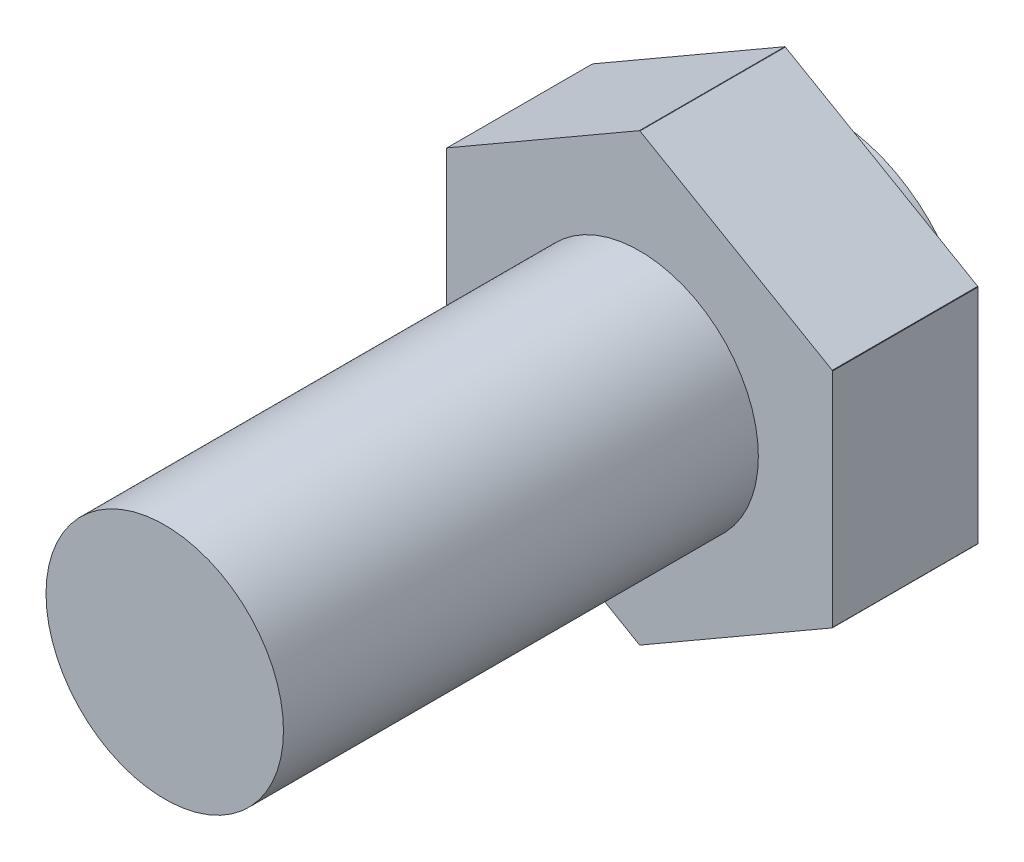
ISO-10303-21;
HEADER;
FILE_DESCRIPTION(('STEP AP214'),'2;1');
FILE_NAME('part.step','',(''),(''),'','','');
FILE_SCHEMA(('AUTOMOTIVE_DESIGN { 1 0 10303 214 1 1 1 1 }'));
ENDSEC;
DATA;
#1=APPLICATION_CONTEXT('core data for automotive mechanical design processes');
#2=APPLICATION_PROTOCOL_DEFINITION('international standard','automotive_design',2000,#1);
#3=PRODUCT_CONTEXT('',#1,'mechanical');
#4=PRODUCT('Part','Part','',(#3));
#5=PRODUCT_RELATED_PRODUCT_CATEGORY('part','',(#4));
#6=PRODUCT_DEFINITION_FORMATION('','',#4);
#7=PRODUCT_DEFINITION_CONTEXT('part definition',#1,'design');
#8=PRODUCT_DEFINITION('design','',#6,#7);
#9=PRODUCT_DEFINITION_SHAPE('','',#8);
#10=(LENGTH_UNIT() NAMED_UNIT(*) SI_UNIT(.MILLI.,.METRE.));
#11=(NAMED_UNIT(*) PLANE_ANGLE_UNIT() SI_UNIT($,.RADIAN.));
#12=(NAMED_UNIT(*) SI_UNIT($,.STERADIAN.) SOLID_ANGLE_UNIT());
#13=UNCERTAINTY_MEASURE_WITH_UNIT(LENGTH_MEASURE(1.E-05),#10,'distance_accuracy_value','');
#14=(GEOMETRIC_REPRESENTATION_CONTEXT(3) GLOBAL_UNCERTAINTY_ASSIGNED_CONTEXT((#13)) GLOBAL_UNIT_ASSIGNED_CONTEXT((#10,
#11,#12)) REPRESENTATION_CONTEXT('',''));
#15=CARTESIAN_POINT('',(0.,0.,0.));
#16=DIRECTION('',(0.,0.,1.));
#17=DIRECTION('',(1.,0.,0.));
#18=AXIS2_PLACEMENT_3D('',#15,#16,#17);
#19=CARTESIAN_POINT('',(0.,0.,-38.6));
#20=DIRECTION('',(0.,0.,-1.));
#21=DIRECTION('',(-1.,0.,0.));
#22=AXIS2_PLACEMENT_3D('',#19,#20,#21);
#23=CYLINDRICAL_SURFACE('',#22,4.);
#24=CARTESIAN_POINT('',(0.,0.,6.4));
#25=DIRECTION('',(0.,0.,-1.));
#26=DIRECTION('',(-1.,0.,0.));
#27=AXIS2_PLACEMENT_3D('',#24,#25,#26);
#28=CIRCLE('',#27,4.);
#29=CARTESIAN_POINT('',(-4.,0.,6.4));
#30=VERTEX_POINT('',#29);
#31=EDGE_CURVE('E23',#30,#30,#28,.T.);
#32=ORIENTED_EDGE('',*,*,#31,.F.);
#33=EDGE_LOOP('',(#32));
#34=FACE_BOUND('',#33,.T.);
#35=CARTESIAN_POINT('',(0.,0.,22.4));
#36=DIRECTION('',(0.,0.,1.));
#37=DIRECTION('',(1.,0.,0.));
#38=AXIS2_PLACEMENT_3D('',#35,#36,#37);
#39=CIRCLE('',#38,4.);
#40=CARTESIAN_POINT('',(4.,0.,22.4));
#41=VERTEX_POINT('',#40);
#42=EDGE_CURVE('E141',#41,#41,#39,.T.);
#43=ORIENTED_EDGE('',*,*,#42,.F.);
#44=EDGE_LOOP('',(#43));
#45=FACE_BOUND('',#44,.T.);
#46=ADVANCED_FACE('F15',(#34,#45),#23,.T.);
#47=CARTESIAN_POINT('',(-4.,0.,6.4));
#48=DIRECTION('',(0.,0.,-1.));
#49=DIRECTION('',(-1.,0.,0.));
#50=AXIS2_PLACEMENT_3D('',#47,#48,#49);
#51=PLANE('',#50);
#52=ORIENTED_EDGE('',*,*,#31,.T.);
#53=EDGE_LOOP('',(#52));
#54=FACE_BOUND('',#53,.T.);
#55=CARTESIAN_POINT('',(0.,0.,6.4));
#56=DIRECTION('',(0.,0.,-1.));
#57=DIRECTION('',(-1.,0.,0.));
#58=AXIS2_PLACEMENT_3D('',#55,#56,#57);
#59=CIRCLE('',#58,7.5);
#60=CARTESIAN_POINT('',(-0.00962965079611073,7.49999381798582,6.4));
#61=VERTEX_POINT('',#60);
#62=CARTESIAN_POINT('',(0.00962965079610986,7.49999381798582,6.4));
#63=VERTEX_POINT('',#62);
#64=EDGE_CURVE('E130',#61,#63,#59,.T.);
#65=ORIENTED_EDGE('',*,*,#64,.F.);
#66=DIRECTION('',(-0.866025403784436,-0.5,0.));
#67=VECTOR('',#66,1.);
#68=CARTESIAN_POINT('',(-6.25,3.89711431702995,6.4));
#69=LINE('',#68,#67);
#70=CARTESIAN_POINT('',(-6.49037034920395,3.75833643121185,6.4));
#71=VERTEX_POINT('',#70);
#72=EDGE_CURVE('E115',#61,#71,#69,.T.);
#73=ORIENTED_EDGE('',*,*,#72,.T.);
#74=CARTESIAN_POINT('',(-6.5,3.74165738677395,6.4));
#75=VERTEX_POINT('',#74);
#76=EDGE_CURVE('E127',#75,#71,#59,.T.);
#77=ORIENTED_EDGE('',*,*,#76,.F.);
#78=DIRECTION('',(0.,-1.,0.));
#79=VECTOR('',#78,1.);
#80=CARTESIAN_POINT('',(-6.5,0.,6.4));
#81=LINE('',#80,#79);
#82=CARTESIAN_POINT('',(-6.5,-3.74165738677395,6.4));
#83=VERTEX_POINT('',#82);
#84=EDGE_CURVE('E121',#75,#83,#81,.T.);
#85=ORIENTED_EDGE('',*,*,#84,.T.);
#86=CARTESIAN_POINT('',(-6.49037034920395,-3.75833643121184,6.4));
#87=VERTEX_POINT('',#86);
#88=EDGE_CURVE('E126',#87,#83,#59,.T.);
#89=ORIENTED_EDGE('',*,*,#88,.F.);
#90=DIRECTION('',(-0.866025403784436,0.5,0.));
#91=VECTOR('',#90,1.);
#92=CARTESIAN_POINT('',(-6.25,-3.89711431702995,6.4));
#93=LINE('',#92,#91);
#94=CARTESIAN_POINT('',(-0.00962965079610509,-7.49999381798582,6.4));
#95=VERTEX_POINT('',#94);
#96=EDGE_CURVE('E195',#95,#87,#93,.T.);
#97=ORIENTED_EDGE('',*,*,#96,.F.);
#98=CARTESIAN_POINT('',(0.00962965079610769,-7.49999381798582,6.4));
#99=VERTEX_POINT('',#98);
#100=EDGE_CURVE('E212',#99,#95,#59,.T.);
#101=ORIENTED_EDGE('',*,*,#100,.F.);
#102=DIRECTION('',(0.866025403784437,0.5,0.));
#103=VECTOR('',#102,1.);
#104=CARTESIAN_POINT('',(0.250000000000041,-7.36121593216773,6.4));
#105=LINE('',#104,#103);
#106=CARTESIAN_POINT('',(6.49037034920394,-3.75833643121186,6.4));
#107=VERTEX_POINT('',#106);
#108=EDGE_CURVE('E187',#99,#107,#105,.T.);
#109=ORIENTED_EDGE('',*,*,#108,.T.);
#110=CARTESIAN_POINT('',(6.5,-3.74165738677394,6.4));
#111=VERTEX_POINT('',#110);
#112=EDGE_CURVE('E214',#111,#107,#59,.T.);
#113=ORIENTED_EDGE('',*,*,#112,.F.);
#114=DIRECTION('',(0.,-1.,0.));
#115=VECTOR('',#114,1.);
#116=CARTESIAN_POINT('',(6.5,0.,6.4));
#117=LINE('',#116,#115);
#118=CARTESIAN_POINT('',(6.5,3.74165738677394,6.4));
#119=VERTEX_POINT('',#118);
#120=EDGE_CURVE('E180',#119,#111,#117,.T.);
#121=ORIENTED_EDGE('',*,*,#120,.F.);
#122=CARTESIAN_POINT('',(6.49037034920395,3.75833643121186,6.4));
#123=VERTEX_POINT('',#122);
#124=EDGE_CURVE('E219',#123,#119,#59,.T.);
#125=ORIENTED_EDGE('',*,*,#124,.F.);
#126=DIRECTION('',(0.866025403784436,-0.5,0.));
#127=VECTOR('',#126,1.);
#128=CARTESIAN_POINT('',(0.250000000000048,7.36121593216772,6.4));
#129=LINE('',#128,#127);
#130=EDGE_CURVE('E173',#63,#123,#129,.T.);
#131=ORIENTED_EDGE('',*,*,#130,.F.);
#132=EDGE_LOOP('',(#65,#73,#77,#85,#89,#97,#101,#109,#113,#121,#125,#131));
#133=FACE_BOUND('',#132,.T.);
#134=ADVANCED_FACE('F134',(#54,#133),#51,.F.);
#135=CARTESIAN_POINT('',(0.,0.,-38.6));
#136=DIRECTION('',(0.,0.,-1.));
#137=DIRECTION('',(-1.,0.,0.));
#138=AXIS2_PLACEMENT_3D('',#135,#136,#137);
#139=CYLINDRICAL_SURFACE('',#138,7.5);
#140=DIRECTION('',(0.,0.,-1.));
#141=VECTOR('',#140,1.);
#142=CARTESIAN_POINT('',(-6.49037034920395,3.75833643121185,-38.6));
#143=LINE('',#142,#141);
#144=CARTESIAN_POINT('',(-6.49037034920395,3.75833643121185,1.5));
#145=VERTEX_POINT('',#144);
#146=EDGE_CURVE('E36',#71,#145,#143,.T.);
#147=ORIENTED_EDGE('',*,*,#146,.T.);
#148=CARTESIAN_POINT('',(0.,0.,1.5));
#149=DIRECTION('',(0.,0.,1.));
#150=DIRECTION('',(1.,0.,0.));
#151=AXIS2_PLACEMENT_3D('',#148,#149,#150);
#152=CIRCLE('',#151,7.5);
#153=CARTESIAN_POINT('',(-6.5,3.74165738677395,1.5));
#154=VERTEX_POINT('',#153);
#155=EDGE_CURVE('E30',#145,#154,#152,.T.);
#156=ORIENTED_EDGE('',*,*,#155,.T.);
#157=DIRECTION('',(0.,0.,-1.));
#158=VECTOR('',#157,1.);
#159=CARTESIAN_POINT('',(-6.5,3.74165738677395,-38.6));
#160=LINE('',#159,#158);
#161=EDGE_CURVE('E200',#154,#75,#160,.F.);
#162=ORIENTED_EDGE('',*,*,#161,.T.);
#163=ORIENTED_EDGE('',*,*,#76,.T.);
#164=EDGE_LOOP('',(#147,#156,#162,#163));
#165=FACE_BOUND('',#164,.T.);
#166=ADVANCED_FACE('F247',(#165),#139,.T.);
#167=DIRECTION('',(0.,0.,-1.));
#168=VECTOR('',#167,1.);
#169=CARTESIAN_POINT('',(-6.5,-3.74165738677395,-38.6));
#170=LINE('',#169,#168);
#171=CARTESIAN_POINT('',(-6.5,-3.74165738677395,1.5));
#172=VERTEX_POINT('',#171);
#173=EDGE_CURVE('E117',#83,#172,#170,.T.);
#174=ORIENTED_EDGE('',*,*,#173,.T.);
#175=CARTESIAN_POINT('',(0.,0.,1.5));
#176=DIRECTION('',(0.,0.,1.));
#177=DIRECTION('',(1.,0.,0.));
#178=AXIS2_PLACEMENT_3D('',#175,#176,#177);
#179=CIRCLE('',#178,7.5);
#180=CARTESIAN_POINT('',(-6.49037034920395,-3.75833643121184,1.5));
#181=VERTEX_POINT('',#180);
#182=EDGE_CURVE('E156',#172,#181,#179,.T.);
#183=ORIENTED_EDGE('',*,*,#182,.T.);
#184=DIRECTION('',(0.,0.,-1.));
#185=VECTOR('',#184,1.);
#186=CARTESIAN_POINT('',(-6.49037034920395,-3.75833643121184,-38.6));
#187=LINE('',#186,#185);
#188=EDGE_CURVE('E197',#87,#181,#187,.T.);
#189=ORIENTED_EDGE('',*,*,#188,.F.);
#190=ORIENTED_EDGE('',*,*,#88,.T.);
#191=EDGE_LOOP('',(#174,#183,#189,#190));
#192=FACE_BOUND('',#191,.T.);
#193=ADVANCED_FACE('F211',(#192),#139,.T.);
#194=DIRECTION('',(0.,0.,-1.));
#195=VECTOR('',#194,1.);
#196=CARTESIAN_POINT('',(0.00962965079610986,7.49999381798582,-38.6));
#197=LINE('',#196,#195);
#198=CARTESIAN_POINT('',(0.00962965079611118,7.49999381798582,1.5));
#199=VERTEX_POINT('',#198);
#200=EDGE_CURVE('E111',#199,#63,#197,.F.);
#201=ORIENTED_EDGE('',*,*,#200,.F.);
#202=CARTESIAN_POINT('',(0.,0.,1.5));
#203=DIRECTION('',(0.,0.,1.));
#204=DIRECTION('',(1.,0.,0.));
#205=AXIS2_PLACEMENT_3D('',#202,#203,#204);
#206=CIRCLE('',#205,7.5);
#207=CARTESIAN_POINT('',(-0.00962965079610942,7.49999381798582,1.5));
#208=VERTEX_POINT('',#207);
#209=EDGE_CURVE('E103',#199,#208,#206,.T.);
#210=ORIENTED_EDGE('',*,*,#209,.T.);
#211=DIRECTION('',(0.,0.,-1.));
#212=VECTOR('',#211,1.);
#213=CARTESIAN_POINT('',(-0.00962965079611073,7.49999381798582,-38.6));
#214=LINE('',#213,#212);
#215=EDGE_CURVE('E110',#208,#61,#214,.F.);
#216=ORIENTED_EDGE('',*,*,#215,.T.);
#217=ORIENTED_EDGE('',*,*,#64,.T.);
#218=EDGE_LOOP('',(#201,#210,#216,#217));
#219=FACE_BOUND('',#218,.T.);
#220=ADVANCED_FACE('F108',(#219),#139,.T.);
#221=DIRECTION('',(0.,0.,-1.));
#222=VECTOR('',#221,1.);
#223=CARTESIAN_POINT('',(-0.00962965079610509,-7.49999381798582,-38.6));
#224=LINE('',#223,#222);
#225=CARTESIAN_POINT('',(-0.00962965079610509,-7.49999381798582,1.5));
#226=VERTEX_POINT('',#225);
#227=EDGE_CURVE('E193',#226,#95,#224,.F.);
#228=ORIENTED_EDGE('',*,*,#227,.F.);
#229=CARTESIAN_POINT('',(0.,0.,1.5));
#230=DIRECTION('',(0.,0.,1.));
#231=DIRECTION('',(1.,0.,0.));
#232=AXIS2_PLACEMENT_3D('',#229,#230,#231);
#233=CIRCLE('',#232,7.5);
#234=CARTESIAN_POINT('',(0.00962965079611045,-7.49999381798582,1.5));
#235=VERTEX_POINT('',#234);
#236=EDGE_CURVE('E166',#226,#235,#233,.T.);
#237=ORIENTED_EDGE('',*,*,#236,.T.);
#238=DIRECTION('',(0.,0.,-1.));
#239=VECTOR('',#238,1.);
#240=CARTESIAN_POINT('',(0.00962965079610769,-7.49999381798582,-38.6));
#241=LINE('',#240,#239);
#242=EDGE_CURVE('E185',#235,#99,#241,.F.);
#243=ORIENTED_EDGE('',*,*,#242,.T.);
#244=ORIENTED_EDGE('',*,*,#100,.T.);
#245=EDGE_LOOP('',(#228,#237,#243,#244));
#246=FACE_BOUND('',#245,.T.);
#247=ADVANCED_FACE('F242',(#246),#139,.T.);
#248=DIRECTION('',(0.,0.,-1.));
#249=VECTOR('',#248,1.);
#250=CARTESIAN_POINT('',(6.49037034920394,-3.75833643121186,-38.6));
#251=LINE('',#250,#249);
#252=CARTESIAN_POINT('',(6.49037034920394,-3.75833643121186,1.5));
#253=VERTEX_POINT('',#252);
#254=EDGE_CURVE('E190',#107,#253,#251,.T.);
#255=ORIENTED_EDGE('',*,*,#254,.T.);
#256=CARTESIAN_POINT('',(0.,0.,1.5));
#257=DIRECTION('',(0.,0.,1.));
#258=DIRECTION('',(1.,0.,0.));
#259=AXIS2_PLACEMENT_3D('',#256,#257,#258);
#260=CIRCLE('',#259,7.5);
#261=CARTESIAN_POINT('',(6.5,-3.74165738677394,1.5));
#262=VERTEX_POINT('',#261);
#263=EDGE_CURVE('E163',#253,#262,#260,.T.);
#264=ORIENTED_EDGE('',*,*,#263,.T.);
#265=DIRECTION('',(0.,0.,-1.));
#266=VECTOR('',#265,1.);
#267=CARTESIAN_POINT('',(6.5,-3.74165738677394,-38.6));
#268=LINE('',#267,#266);
#269=EDGE_CURVE('E182',#111,#262,#268,.T.);
#270=ORIENTED_EDGE('',*,*,#269,.F.);
#271=ORIENTED_EDGE('',*,*,#112,.T.);
#272=EDGE_LOOP('',(#255,#264,#270,#271));
#273=FACE_BOUND('',#272,.T.);
#274=ADVANCED_FACE('F236',(#273),#139,.T.);
#275=DIRECTION('',(0.,0.,-1.));
#276=VECTOR('',#275,1.);
#277=CARTESIAN_POINT('',(6.5,3.74165738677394,-38.6));
#278=LINE('',#277,#276);
#279=CARTESIAN_POINT('',(6.5,3.74165738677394,1.5));
#280=VERTEX_POINT('',#279);
#281=EDGE_CURVE('E178',#280,#119,#278,.F.);
#282=ORIENTED_EDGE('',*,*,#281,.F.);
#283=CARTESIAN_POINT('',(0.,0.,1.5));
#284=DIRECTION('',(0.,0.,1.));
#285=DIRECTION('',(1.,0.,0.));
#286=AXIS2_PLACEMENT_3D('',#283,#284,#285);
#287=CIRCLE('',#286,7.5);
#288=CARTESIAN_POINT('',(6.49037034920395,3.75833643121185,1.5));
#289=VERTEX_POINT('',#288);
#290=EDGE_CURVE('E153',#280,#289,#287,.T.);
#291=ORIENTED_EDGE('',*,*,#290,.T.);
#292=DIRECTION('',(0.,0.,-1.));
#293=VECTOR('',#292,1.);
#294=CARTESIAN_POINT('',(6.49037034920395,3.75833643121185,-38.6));
#295=LINE('',#294,#293);
#296=EDGE_CURVE('E175',#123,#289,#295,.T.);
#297=ORIENTED_EDGE('',*,*,#296,.F.);
#298=ORIENTED_EDGE('',*,*,#124,.T.);
#299=EDGE_LOOP('',(#282,#291,#297,#298));
#300=FACE_BOUND('',#299,.T.);
#301=ADVANCED_FACE('F232',(#300),#139,.T.);
#302=CARTESIAN_POINT('',(0.,7.50555349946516,10.));
#303=DIRECTION('',(0.5,0.866025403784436,0.));
#304=DIRECTION('',(0.866025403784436,-0.5,0.));
#305=AXIS2_PLACEMENT_3D('',#302,#303,#304);
#306=PLANE('',#305);
#307=DIRECTION('',(0.866025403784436,-0.5,0.));
#308=VECTOR('',#307,1.);
#309=CARTESIAN_POINT('',(0.,7.50555349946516,1.5));
#310=LINE('',#309,#308);
#311=EDGE_CURVE('E151',#199,#289,#310,.T.);
#312=ORIENTED_EDGE('',*,*,#311,.F.);
#313=ORIENTED_EDGE('',*,*,#200,.T.);
#314=ORIENTED_EDGE('',*,*,#130,.T.);
#315=ORIENTED_EDGE('',*,*,#296,.T.);
#316=EDGE_LOOP('',(#312,#313,#314,#315));
#317=FACE_BOUND('',#316,.T.);
#318=ADVANCED_FACE('F231',(#317),#306,.T.);
#319=CARTESIAN_POINT('',(6.5,3.75277674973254,10.));
#320=DIRECTION('',(1.,0.,0.));
#321=DIRECTION('',(0.,0.,-1.));
#322=AXIS2_PLACEMENT_3D('',#319,#320,#321);
#323=PLANE('',#322);
#324=DIRECTION('',(0.,-1.,0.));
#325=VECTOR('',#324,1.);
#326=CARTESIAN_POINT('',(6.5,3.75277674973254,1.5));
#327=LINE('',#326,#325);
#328=EDGE_CURVE('E161',#280,#262,#327,.T.);
#329=ORIENTED_EDGE('',*,*,#328,.F.);
#330=ORIENTED_EDGE('',*,*,#281,.T.);
#331=ORIENTED_EDGE('',*,*,#120,.T.);
#332=ORIENTED_EDGE('',*,*,#269,.T.);
#333=EDGE_LOOP('',(#329,#330,#331,#332));
#334=FACE_BOUND('',#333,.T.);
#335=ADVANCED_FACE('F235',(#334),#323,.T.);
#336=CARTESIAN_POINT('',(0.,-7.50555349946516,10.));
#337=DIRECTION('',(-0.5,0.866025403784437,0.));
#338=DIRECTION('',(0.866025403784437,0.5,0.));
#339=AXIS2_PLACEMENT_3D('',#336,#337,#338);
#340=PLANE('',#339);
#341=ORIENTED_EDGE('',*,*,#242,.F.);
#342=DIRECTION('',(0.866025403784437,0.5,0.));
#343=VECTOR('',#342,1.);
#344=CARTESIAN_POINT('',(0.,-7.50555349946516,1.5));
#345=LINE('',#344,#343);
#346=EDGE_CURVE('E169',#235,#253,#345,.T.);
#347=ORIENTED_EDGE('',*,*,#346,.T.);
#348=ORIENTED_EDGE('',*,*,#254,.F.);
#349=ORIENTED_EDGE('',*,*,#108,.F.);
#350=EDGE_LOOP('',(#341,#347,#348,#349));
#351=FACE_BOUND('',#350,.T.);
#352=ADVANCED_FACE('F240',(#351),#340,.F.);
#353=CARTESIAN_POINT('',(0.,-7.50555349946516,10.));
#354=DIRECTION('',(-0.5,-0.866025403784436,0.));
#355=DIRECTION('',(-0.866025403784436,0.5,0.));
#356=AXIS2_PLACEMENT_3D('',#353,#354,#355);
#357=PLANE('',#356);
#358=DIRECTION('',(-0.866025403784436,0.5,0.));
#359=VECTOR('',#358,1.);
#360=CARTESIAN_POINT('',(0.,-7.50555349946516,1.5));
#361=LINE('',#360,#359);
#362=EDGE_CURVE('E159',#226,#181,#361,.T.);
#363=ORIENTED_EDGE('',*,*,#362,.F.);
#364=ORIENTED_EDGE('',*,*,#227,.T.);
#365=ORIENTED_EDGE('',*,*,#96,.T.);
#366=ORIENTED_EDGE('',*,*,#188,.T.);
#367=EDGE_LOOP('',(#363,#364,#365,#366));
#368=FACE_BOUND('',#367,.T.);
#369=ADVANCED_FACE('F244',(#368),#357,.T.);
#370=CARTESIAN_POINT('',(-6.5,3.75277674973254,10.));
#371=DIRECTION('',(1.,0.,0.));
#372=DIRECTION('',(0.,-1.,0.));
#373=AXIS2_PLACEMENT_3D('',#370,#371,#372);
#374=PLANE('',#373);
#375=ORIENTED_EDGE('',*,*,#161,.F.);
#376=DIRECTION('',(0.,-1.,0.));
#377=VECTOR('',#376,1.);
#378=CARTESIAN_POINT('',(-6.5,3.75277674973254,1.5));
#379=LINE('',#378,#377);
#380=EDGE_CURVE('E148',#154,#172,#379,.T.);
#381=ORIENTED_EDGE('',*,*,#380,.T.);
#382=ORIENTED_EDGE('',*,*,#173,.F.);
#383=ORIENTED_EDGE('',*,*,#84,.F.);
#384=EDGE_LOOP('',(#375,#381,#382,#383));
#385=FACE_BOUND('',#384,.T.);
#386=ADVANCED_FACE('F245',(#385),#374,.F.);
#387=CARTESIAN_POINT('',(0.,7.50555349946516,10.));
#388=DIRECTION('',(0.5,-0.866025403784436,0.));
#389=DIRECTION('',(-0.866025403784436,-0.5,0.));
#390=AXIS2_PLACEMENT_3D('',#387,#388,#389);
#391=PLANE('',#390);
#392=ORIENTED_EDGE('',*,*,#215,.F.);
#393=DIRECTION('',(-0.866025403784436,-0.5,0.));
#394=VECTOR('',#393,1.);
#395=CARTESIAN_POINT('',(0.,7.50555349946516,1.5));
#396=LINE('',#395,#394);
#397=EDGE_CURVE('E9',#208,#145,#396,.T.);
#398=ORIENTED_EDGE('',*,*,#397,.T.);
#399=ORIENTED_EDGE('',*,*,#146,.F.);
#400=ORIENTED_EDGE('',*,*,#72,.F.);
#401=EDGE_LOOP('',(#392,#398,#399,#400));
#402=FACE_BOUND('',#401,.T.);
#403=ADVANCED_FACE('F114',(#402),#391,.F.);
#404=CARTESIAN_POINT('',(0.,0.,-8.6));
#405=DIRECTION('',(0.,0.,-1.));
#406=DIRECTION('',(-1.,0.,0.));
#407=AXIS2_PLACEMENT_3D('',#404,#405,#406);
#408=CYLINDRICAL_SURFACE('',#407,4.75);
#409=CARTESIAN_POINT('',(0.,0.,1.5));
#410=DIRECTION('',(0.,0.,-1.));
#411=DIRECTION('',(-1.,0.,0.));
#412=AXIS2_PLACEMENT_3D('',#409,#410,#411);
#413=CIRCLE('',#412,4.75);
#414=CARTESIAN_POINT('',(-4.75,0.,1.5));
#415=VERTEX_POINT('',#414);
#416=EDGE_CURVE('E112',#415,#415,#413,.T.);
#417=ORIENTED_EDGE('',*,*,#416,.T.);
#418=EDGE_LOOP('',(#417));
#419=FACE_BOUND('',#418,.T.);
#420=CARTESIAN_POINT('',(0.,0.,0.));
#421=DIRECTION('',(0.,0.,1.));
#422=DIRECTION('',(1.,0.,0.));
#423=AXIS2_PLACEMENT_3D('',#420,#421,#422);
#424=CIRCLE('',#423,4.75);
#425=CARTESIAN_POINT('',(4.75,0.,0.));
#426=VERTEX_POINT('',#425);
#427=EDGE_CURVE('E18',#426,#426,#424,.T.);
#428=ORIENTED_EDGE('',*,*,#427,.T.);
#429=EDGE_LOOP('',(#428));
#430=FACE_BOUND('',#429,.T.);
#431=ADVANCED_FACE('F354',(#419,#430),#408,.T.);
#432=CARTESIAN_POINT('',(0.,11.4999999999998,1.5));
#433=DIRECTION('',(0.,0.,1.));
#434=DIRECTION('',(1.,0.,0.));
#435=AXIS2_PLACEMENT_3D('',#432,#433,#434);
#436=PLANE('',#435);
#437=ORIENTED_EDGE('',*,*,#416,.F.);
#438=EDGE_LOOP('',(#437));
#439=FACE_BOUND('',#438,.T.);
#440=ORIENTED_EDGE('',*,*,#236,.F.);
#441=ORIENTED_EDGE('',*,*,#362,.T.);
#442=ORIENTED_EDGE('',*,*,#182,.F.);
#443=ORIENTED_EDGE('',*,*,#380,.F.);
#444=ORIENTED_EDGE('',*,*,#155,.F.);
#445=ORIENTED_EDGE('',*,*,#397,.F.);
#446=ORIENTED_EDGE('',*,*,#209,.F.);
#447=ORIENTED_EDGE('',*,*,#311,.T.);
#448=ORIENTED_EDGE('',*,*,#290,.F.);
#449=ORIENTED_EDGE('',*,*,#328,.T.);
#450=ORIENTED_EDGE('',*,*,#263,.F.);
#451=ORIENTED_EDGE('',*,*,#346,.F.);
#452=EDGE_LOOP('',(#440,#441,#442,#443,#444,#445,#446,#447,#448,#449,#450,#451));
#453=FACE_BOUND('',#452,.T.);
#454=ADVANCED_FACE('F102',(#439,#453),#436,.F.);
#455=CARTESIAN_POINT('',(-7.5,0.,0.));
#456=DIRECTION('',(0.,0.,1.));
#457=DIRECTION('',(1.,0.,0.));
#458=AXIS2_PLACEMENT_3D('',#455,#456,#457);
#459=PLANE('',#458);
#460=ORIENTED_EDGE('',*,*,#427,.F.);
#461=EDGE_LOOP('',(#460));
#462=FACE_BOUND('',#461,.T.);
#463=ADVANCED_FACE('F370',(#462),#459,.F.);
#464=CARTESIAN_POINT('',(0.,0.,22.4));
#465=DIRECTION('',(0.,0.,1.));
#466=DIRECTION('',(1.,0.,0.));
#467=AXIS2_PLACEMENT_3D('',#464,#465,#466);
#468=PLANE('',#467);
#469=ORIENTED_EDGE('',*,*,#42,.T.);
#470=EDGE_LOOP('',(#469));
#471=FACE_BOUND('',#470,.T.);
#472=ADVANCED_FACE('F379',(#471),#468,.T.);
#473=CLOSED_SHELL('',(#46,#134,#166,#193,#220,#247,#274,#301,#318,#335,#352,#369,#386,#403,#431,
#454,#463,#472));
#474=MANIFOLD_SOLID_BREP('B1',#473);
#475=ADVANCED_BREP_SHAPE_REPRESENTATION('',(#18,#474),#14);
#476=SHAPE_DEFINITION_REPRESENTATION(#9,#475);
ENDSEC;
END-ISO-10303-21;
